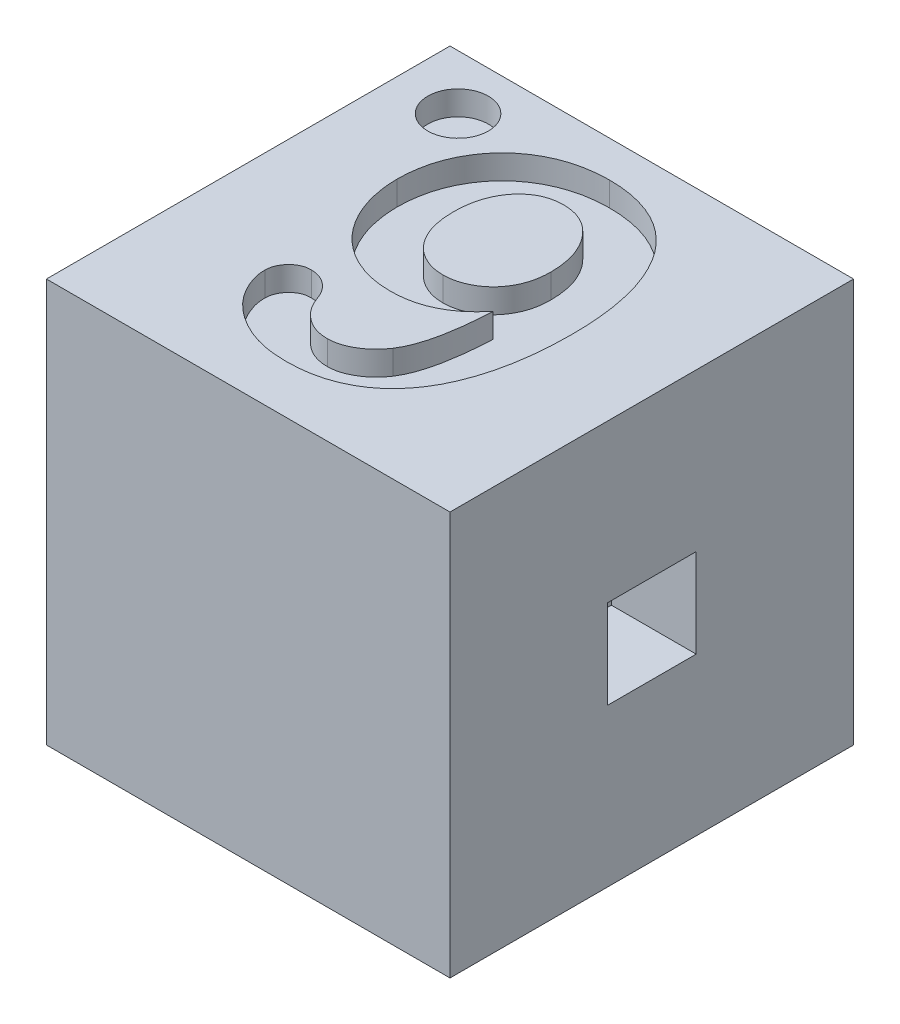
from build123d import *

# Parameters (mm, degrees)
SKETCH1_W           = 10
SKETCH1_H           = 10
BOSS_EXTRUDE1_DEPTH = 10
SKETCH2_W           = 2
SKETCH2_H           = 2
BOSS_EXTRUDE2_DEPTH = 2
SKETCH3_W           = 2.2
SKETCH3_H           = 2.2
CUT_EXTRUDE1_DEPTH  = 2.1
CUT_EXTRUDE2_DEPTH  = 0.6
SKETCH4_R           = 0.75
CUT_EXTRUDE3_DEPTH  = 0.6


with BuildPart() as part:
    # Sketch1 → Boss-Extrude1 (new body)
    with BuildSketch(Plane.XY):
        Rectangle(SKETCH1_W, SKETCH1_H)
    extrude(amount=BOSS_EXTRUDE1_DEPTH)

    # Sketch2 → Boss-Extrude2 (add)
    with BuildSketch(Plane.YZ.offset(-5)):
        with Locations((0, 5)):
            Rectangle(SKETCH2_W, SKETCH2_H)
    extrude(amount=-BOSS_EXTRUDE2_DEPTH)

    # Sketch3 → Cut-Extrude1 (cut)
    with BuildSketch(Plane(origin=(5, 0, 0), x_dir=(0, 1, 0), z_dir=(-1, 0, 0))):
        with Locations((0, -5)):
            Rectangle(SKETCH3_W, SKETCH3_H)
    extrude(amount=CUT_EXTRUDE1_DEPTH, mode=Mode.SUBTRACT)

    # TextSketch → Cut-Extrude2 (cut)
    with BuildSketch(Plane(origin=(0, 5, 0), x_dir=(0, 0, 1), z_dir=(0, -1, 0))):
        with BuildLine():
            add(Edge.make_bspline(
                [(5.1625, -1.228125), (5.230535, -1.169125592), (5.363267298, -1.054021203), (5.534588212, -0.861956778), (5.681216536, -0.664292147), (5.797065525, -0.455692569), (5.889417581, -0.238708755), (5.953118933, -0.009162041), (5.993627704, 0.232410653), (5.997848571, 0.398271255), (6, 0.4828125)],
                knots=[0, 0, 0, 0, 1.094222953, 2.134764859, 3.123014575, 4.081585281, 5.029802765, 5.984304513, 6.97257453, 8, 8, 8, 8], degree=3))
            add(Edge.make_bspline(
                [(6, 0.4828125), (5.998265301, 0.564215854), (5.994844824, 0.724726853), (5.956717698, 0.960089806), (5.899823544, 1.186665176), (5.817966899, 1.402087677), (5.716147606, 1.606408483), (5.593611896, 1.798160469), (5.450414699, 1.976523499), (5.290126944, 2.142319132), (5.110902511, 2.291511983), (4.914959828, 2.422225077), (4.704725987, 2.537444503), (4.480361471, 2.631606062), (4.246239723, 2.707082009), (4.004894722, 2.759272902), (3.758812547, 2.793919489), (3.592825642, 2.797965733), (3.509375, 2.8)],
                knots=[0, 0, 0, 0, 1.028361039, 2.027720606, 3.006826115, 3.97799307, 4.935148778, 5.888741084, 6.849334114, 7.82266445, 8.799907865, 9.791687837, 10.796586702, 11.826464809, 12.863623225, 13.90220235, 14.945323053, 16, 16, 16, 16], degree=3))
            add(Edge.make_bspline(
                [(3.509375, 2.8), (3.448911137, 2.799386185), (3.328769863, 2.798166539), (3.150947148, 2.779643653), (2.977274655, 2.753271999), (2.807191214, 2.718022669), (2.642224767, 2.668717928), (2.480573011, 2.611389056), (2.323961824, 2.542336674), (2.123224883, 2.436507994), (1.887053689, 2.282026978), (1.633304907, 2.060702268), (1.414913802, 1.803699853), (1.258787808, 1.566858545), (1.156794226, 1.361838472), (1.086742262, 1.203414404), (1.028911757, 1.038825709), (0.982975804, 0.86882314), (0.944454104, 0.694334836), (0.918479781, 0.514702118), (0.902267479, 0.329991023), (0.900761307, 0.205242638), (0.9, 0.1421875)],
                knots=[0, 0, 0, 0, 0.86949027, 1.727671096, 2.569103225, 3.396505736, 4.224043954, 5.044119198, 5.862755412, 6.683925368, 8.307042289, 9.9106708, 11.510144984, 13.14580486, 13.976863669, 14.802363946, 15.636558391, 16.483676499, 17.334630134, 18.205701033, 19.093056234, 20, 20, 20, 20], degree=3))
            add(Edge.make_bspline(
                [(0.9, 0.1421875), (0.901055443, 0.069744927), (0.903132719, -0.072833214), (0.9238597, -0.282781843), (0.958449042, -0.484690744), (1.005060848, -0.679700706), (1.065936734, -0.866633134), (1.139876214, -1.046436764), (1.227318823, -1.218553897), (1.32897079, -1.382495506), (1.443855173, -1.538247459), (1.571439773, -1.685047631), (1.713682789, -1.82121073), (1.866260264, -1.949813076), (2.033227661, -2.067552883), (2.213662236, -2.174634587), (2.405434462, -2.27539814), (2.611161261, -2.363800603), (2.828421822, -2.443886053), (3.058156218, -2.512278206), (3.299365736, -2.56936865), (3.551377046, -2.618934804), (3.816098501, -2.653585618), (4.092309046, -2.679838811), (4.380481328, -2.69830956), (4.576532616, -2.699428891), (4.6765625, -2.7)],
                knots=[0, 0, 0, 0, 0.974905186, 1.918763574, 2.836215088, 3.73063544, 4.6152478, 5.479739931, 6.345112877, 7.210883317, 8.07324072, 8.947766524, 9.825350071, 10.721198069, 11.631550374, 12.571782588, 13.543860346, 14.545448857, 15.583474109, 16.659238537, 17.769626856, 18.919099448, 20.114847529, 21.361470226, 22.653761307, 24, 24, 24, 24], degree=3))
            add(Edge.make_bspline(
                [(4.6765625, -2.7), (4.83810845, -2.697889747), (5.152845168, -2.693778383), (5.611994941, -2.653491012), (6.044820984, -2.590658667), (6.450375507, -2.502419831), (6.825429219, -2.388665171), (7.168949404, -2.253555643), (7.479642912, -2.095752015), (7.755960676, -1.913848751), (8.000337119, -1.711135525), (8.213606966, -1.487831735), (8.394033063, -1.243054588), (8.542187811, -0.977812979), (8.658217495, -0.693464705), (8.741443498, -0.389351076), (8.789750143, -0.066130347), (8.796535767, 0.155567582), (8.8, 0.26875)],
                knots=[0, 0, 0, 0, 1.350752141, 2.631643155, 3.851349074, 5.006502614, 6.099187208, 7.125626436, 8.089925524, 9.00808334, 9.886468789, 10.739908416, 11.58409409, 12.422630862, 13.27437923, 14.146173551, 15.053574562, 16, 16, 16, 16], degree=3))
            add(Edge.make_bspline(
                [(8.8, 0.26875), (8.796797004, 0.377810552), (8.79056978, 0.589844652), (8.739262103, 0.898361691), (8.655851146, 1.186889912), (8.537729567, 1.452450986), (8.396365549, 1.692032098), (8.237209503, 1.90318352), (8.060301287, 2.0820695), (7.870515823, 2.228249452), (7.675169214, 2.342316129), (7.480338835, 2.422351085), (7.290486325, 2.477113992), (7.163365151, 2.483051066), (7.1015625, 2.4859375)],
                knots=[0, 0, 0, 0, 1.276661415, 2.482068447, 3.651803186, 4.785235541, 5.876382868, 6.903646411, 7.874157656, 8.813634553, 9.701910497, 10.514148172, 11.277621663, 12, 12, 12, 12], degree=3))
            add(Edge.make_bspline(
                [(7.1015625, 2.4859375), (7.06542773, 2.48365336), (6.994009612, 2.4791389), (6.889048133, 2.448045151), (6.7908362, 2.39532757), (6.698686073, 2.325970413), (6.621346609, 2.239616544), (6.563063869, 2.140065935), (6.527274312, 2.028428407), (6.523705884, 1.949745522), (6.521875, 1.909375)],
                knots=[0, 0, 0, 0, 0.956845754, 1.891145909, 2.872348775, 3.896083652, 4.931833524, 5.920958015, 6.933287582, 8, 8, 8, 8], degree=3))
            add(Edge.make_bspline(
                [(6.521875, 1.909375), (6.523649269, 1.873244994), (6.527200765, 1.800924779), (6.557016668, 1.695437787), (6.602983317, 1.593529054), (6.667362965, 1.497066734), (6.74774423, 1.408109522), (6.845702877, 1.332475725), (6.9561912, 1.267666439), (7.037992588, 1.23733514), (7.0796875, 1.221875)],
                knots=[0, 0, 0, 0, 0.91549223, 1.832509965, 2.761265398, 3.743773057, 4.76362645, 5.789628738, 6.873353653, 8, 8, 8, 8], degree=3))
            add(Edge.make_bspline(
                [(7.0796875, 1.221875), (7.13203246, 1.200525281), (7.235183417, 1.158453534), (7.374224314, 1.069254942), (7.498900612, 0.965174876), (7.60423405, 0.842714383), (7.693460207, 0.707983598), (7.753632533, 0.558434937), (7.793458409, 0.3999883), (7.79778884, 0.290354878), (7.8, 0.234375)],
                knots=[0, 0, 0, 0, 1.038562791, 2.046591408, 3.026091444, 4.018083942, 5.00993747, 5.98553613, 6.971395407, 8, 8, 8, 8], degree=3))
            add(Edge.make_bspline(
                [(7.8, 0.234375), (7.797531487, 0.188418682), (7.792518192, 0.095086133), (7.762774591, -0.04437457), (7.70901517, -0.182294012), (7.637469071, -0.318351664), (7.549817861, -0.450086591), (7.444792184, -0.571580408), (7.326918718, -0.68291356), (7.238280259, -0.746287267), (7.19375, -0.778125)],
                knots=[0, 0, 0, 0, 0.90034575, 1.828509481, 2.777508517, 3.790242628, 4.834032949, 5.868362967, 6.929106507, 8, 8, 8, 8], degree=3))
            add(Edge.make_bspline(
                [(7.19375, -0.778125), (7.142311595, -0.809534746), (7.033496, -0.875980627), (6.847209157, -0.955770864), (6.633765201, -1.024389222), (6.393826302, -1.088432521), (6.124777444, -1.135433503), (5.829028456, -1.178748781), (5.505119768, -1.209053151), (5.27973516, -1.221599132), (5.1625, -1.228125)],
                knots=[0, 0, 0, 0, 0.687489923, 1.4543535, 2.306270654, 3.246743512, 4.287180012, 5.42257473, 6.659336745, 8, 8, 8, 8], degree=3))
        make_face()
        with BuildLine():
            add(Edge.make_bspline(
                [(2, 0.184375), (2.001035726, 0.227169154), (2.003081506, 0.311696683), (2.024260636, 0.43533539), (2.057290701, 0.553651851), (2.102267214, 0.666936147), (2.162385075, 0.773553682), (2.235258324, 0.874167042), (2.31972329, 0.970347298), (2.418470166, 1.058427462), (2.526477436, 1.139767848), (2.645282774, 1.208128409), (2.770696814, 1.268545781), (2.905003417, 1.31610281), (3.047026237, 1.354379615), (3.19774204, 1.379824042), (3.356315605, 1.398289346), (3.465047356, 1.399423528), (3.5203125, 1.4)],
                knots=[0, 0, 0, 0, 0.942149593, 1.860945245, 2.754746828, 3.645522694, 4.539471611, 5.443965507, 6.378888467, 7.353874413, 8.354590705, 9.352473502, 10.368859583, 11.417955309, 12.486886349, 13.605721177, 14.783058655, 16, 16, 16, 16], degree=3))
            add(Edge.make_bspline(
                [(3.5203125, 1.4), (3.594926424, 1.398655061), (3.739139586, 1.396055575), (3.946906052, 1.363226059), (4.139155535, 1.314221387), (4.314956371, 1.244296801), (4.471447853, 1.154244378), (4.6110206, 1.051380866), (4.729116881, 0.931357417), (4.826975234, 0.797536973), (4.902551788, 0.652077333), (4.96045564, 0.499377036), (4.993728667, 0.338411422), (4.997895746, 0.228792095), (5, 0.1734375)],
                knots=[0, 0, 0, 0, 1.245019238, 2.406362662, 3.503512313, 4.553472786, 5.554739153, 6.51160436, 7.440420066, 8.355612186, 9.270018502, 10.170036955, 11.075921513, 12, 12, 12, 12], degree=3))
            add(Edge.make_bspline(
                [(5, 0.1734375), (4.997707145, 0.120184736), (4.993105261, 0.013303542), (4.961657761, -0.144797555), (4.906512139, -0.298383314), (4.834375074, -0.447866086), (4.74037032, -0.587805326), (4.62899995, -0.716674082), (4.49551586, -0.827560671), (4.345999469, -0.924594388), (4.180065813, -1.00286767), (3.99931773, -1.059319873), (3.805014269, -1.094503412), (3.670465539, -1.09813847), (3.6015625, -1.1)],
                knots=[0, 0, 0, 0, 0.908871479, 1.824154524, 2.73788214, 3.688071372, 4.649628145, 5.607149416, 6.584883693, 7.600789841, 8.642656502, 9.705400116, 10.824924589, 12, 12, 12, 12], degree=3))
            add(Edge.make_bspline(
                [(3.6015625, -1.1), (3.545786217, -1.098734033), (3.436051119, -1.096243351), (3.274708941, -1.078537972), (3.120461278, -1.051111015), (2.97306578, -1.011410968), (2.832788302, -0.960985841), (2.701193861, -0.895185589), (2.574668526, -0.822248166), (2.457674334, -0.736560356), (2.349615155, -0.644311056), (2.257022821, -0.542684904), (2.176178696, -0.437014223), (2.112298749, -0.323485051), (2.061522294, -0.205216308), (2.025090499, -0.081001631), (2.005140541, 0.049878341), (2.001734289, 0.138999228), (2, 0.184375)],
                knots=[0, 0, 0, 0, 1.16955164, 2.300993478, 3.400074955, 4.45195428, 5.499002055, 6.519973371, 7.533438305, 8.558142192, 9.556902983, 10.507685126, 11.436119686, 12.341128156, 13.231785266, 14.130510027, 15.048151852, 16, 16, 16, 16], degree=3))
        make_face(mode=Mode.SUBTRACT)
    extrude(amount=CUT_EXTRUDE2_DEPTH, mode=Mode.SUBTRACT)

    # Sketch4 → Cut-Extrude3 (cut)
    with BuildSketch(Plane(origin=(0, 5, 0), x_dir=(1, 0, 0), z_dir=(0, 1, 0))):
        with Locations(Location((-3.45, -1.35, 0), (0, 0, 270))):
            Circle(SKETCH4_R)
    extrude(amount=-CUT_EXTRUDE3_DEPTH, mode=Mode.SUBTRACT)


solid = part.part
